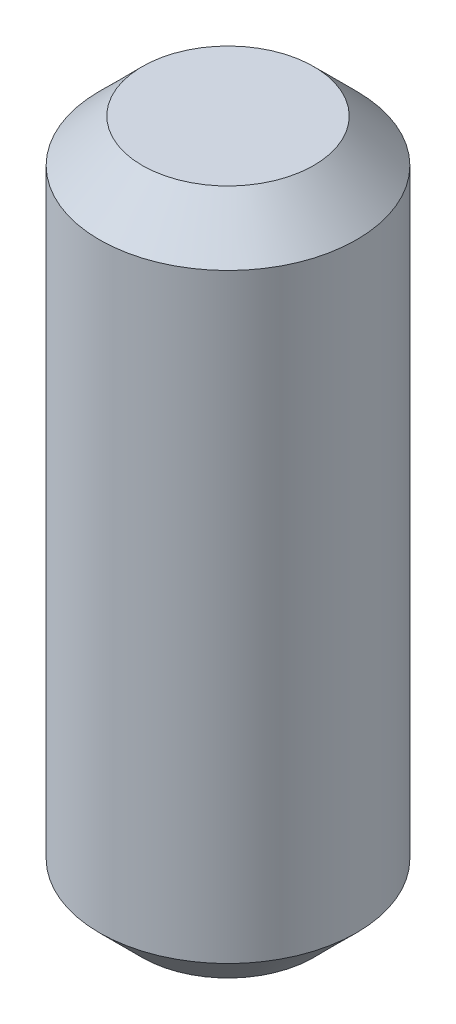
from build123d import *

# Parameters (mm, degrees)
SKIZZE1_R                       = 1.5
AUFSATZ_LINEAR_AUSTRAGEN1_DEPTH = 8
FASE1_SIZE                      = 0.5


with BuildPart() as part:
    # Skizze1 → Aufsatz-Linear austragen1 (new body)
    with BuildSketch(Plane(origin=(0, 0, 0), x_dir=(1, 0, 0), z_dir=(0, 1, 0))):
        with Locations(Location((0, 0, 0), (0, 0, 270))):
            Circle(SKIZZE1_R)
    extrude(amount=AUFSATZ_LINEAR_AUSTRAGEN1_DEPTH)

    # Fase1
    fase1_edges = [part.edges().sort_by_distance(p)[0] for p in [
        (0, 0, -1.5),
        (0, 8, -1.5),
    ]]
    chamfer(fase1_edges, length=FASE1_SIZE)


solid = part.part
